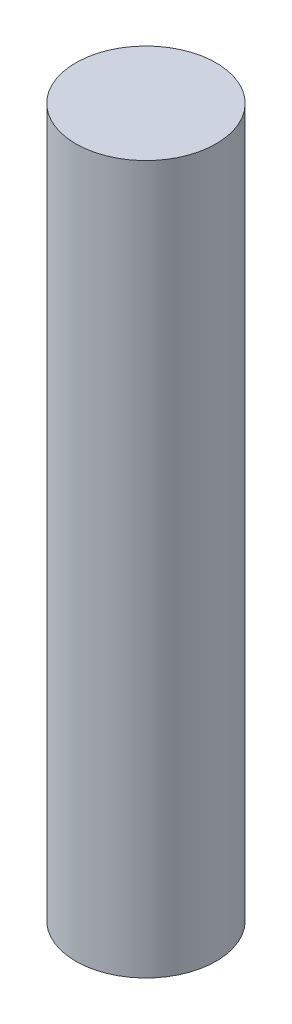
ISO-10303-21;
HEADER;
FILE_DESCRIPTION(('STEP AP214'),'2;1');
FILE_NAME('part.step','',(''),(''),'','','');
FILE_SCHEMA(('AUTOMOTIVE_DESIGN { 1 0 10303 214 1 1 1 1 }'));
ENDSEC;
DATA;
#1=APPLICATION_CONTEXT('core data for automotive mechanical design processes');
#2=APPLICATION_PROTOCOL_DEFINITION('international standard','automotive_design',2000,#1);
#3=PRODUCT_CONTEXT('',#1,'mechanical');
#4=PRODUCT('Part','Part','',(#3));
#5=PRODUCT_RELATED_PRODUCT_CATEGORY('part','',(#4));
#6=PRODUCT_DEFINITION_FORMATION('','',#4);
#7=PRODUCT_DEFINITION_CONTEXT('part definition',#1,'design');
#8=PRODUCT_DEFINITION('design','',#6,#7);
#9=PRODUCT_DEFINITION_SHAPE('','',#8);
#10=(LENGTH_UNIT() NAMED_UNIT(*) SI_UNIT(.MILLI.,.METRE.));
#11=(NAMED_UNIT(*) PLANE_ANGLE_UNIT() SI_UNIT($,.RADIAN.));
#12=(NAMED_UNIT(*) SI_UNIT($,.STERADIAN.) SOLID_ANGLE_UNIT());
#13=UNCERTAINTY_MEASURE_WITH_UNIT(LENGTH_MEASURE(1.E-05),#10,'distance_accuracy_value','');
#14=(GEOMETRIC_REPRESENTATION_CONTEXT(3) GLOBAL_UNCERTAINTY_ASSIGNED_CONTEXT((#13)) GLOBAL_UNIT_ASSIGNED_CONTEXT((#10,
#11,#12)) REPRESENTATION_CONTEXT('',''));
#15=CARTESIAN_POINT('',(0.,0.,0.));
#16=DIRECTION('',(0.,0.,1.));
#17=DIRECTION('',(1.,0.,0.));
#18=AXIS2_PLACEMENT_3D('',#15,#16,#17);
#19=CARTESIAN_POINT('',(0.,5.85,0.));
#20=DIRECTION('',(0.,-1.,0.));
#21=DIRECTION('',(0.,0.,-1.));
#22=AXIS2_PLACEMENT_3D('',#19,#20,#21);
#23=CYLINDRICAL_SURFACE('',#22,0.580000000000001);
#24=CARTESIAN_POINT('',(0.,5.85,0.));
#25=DIRECTION('',(0.,1.,0.));
#26=DIRECTION('',(0.,0.,1.));
#27=AXIS2_PLACEMENT_3D('',#24,#25,#26);
#28=CIRCLE('',#27,0.580000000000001);
#29=CARTESIAN_POINT('',(0.,5.85,0.580000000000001));
#30=VERTEX_POINT('',#29);
#31=EDGE_CURVE('E10',#30,#30,#28,.T.);
#32=ORIENTED_EDGE('',*,*,#31,.F.);
#33=EDGE_LOOP('',(#32));
#34=FACE_BOUND('',#33,.T.);
#35=CARTESIAN_POINT('',(0.,0.,0.));
#36=DIRECTION('',(0.,1.,0.));
#37=DIRECTION('',(0.,0.,1.));
#38=AXIS2_PLACEMENT_3D('',#35,#36,#37);
#39=CIRCLE('',#38,0.580000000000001);
#40=CARTESIAN_POINT('',(0.,0.,0.580000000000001));
#41=VERTEX_POINT('',#40);
#42=EDGE_CURVE('E38',#41,#41,#39,.T.);
#43=ORIENTED_EDGE('',*,*,#42,.T.);
#44=EDGE_LOOP('',(#43));
#45=FACE_BOUND('',#44,.T.);
#46=ADVANCED_FACE('F35',(#34,#45),#23,.T.);
#47=CARTESIAN_POINT('',(0.,5.85,0.));
#48=DIRECTION('',(0.,1.,0.));
#49=DIRECTION('',(0.,0.,1.));
#50=AXIS2_PLACEMENT_3D('',#47,#48,#49);
#51=PLANE('',#50);
#52=ORIENTED_EDGE('',*,*,#31,.T.);
#53=EDGE_LOOP('',(#52));
#54=FACE_BOUND('',#53,.T.);
#55=ADVANCED_FACE('F50',(#54),#51,.T.);
#56=CARTESIAN_POINT('',(0.,0.,0.));
#57=DIRECTION('',(0.,1.,0.));
#58=DIRECTION('',(0.,0.,1.));
#59=AXIS2_PLACEMENT_3D('',#56,#57,#58);
#60=PLANE('',#59);
#61=ORIENTED_EDGE('',*,*,#42,.F.);
#62=EDGE_LOOP('',(#61));
#63=FACE_BOUND('',#62,.T.);
#64=ADVANCED_FACE('F48',(#63),#60,.F.);
#65=CLOSED_SHELL('',(#46,#55,#64));
#66=MANIFOLD_SOLID_BREP('B2',#65);
#67=ADVANCED_BREP_SHAPE_REPRESENTATION('',(#18,#66),#14);
#68=SHAPE_DEFINITION_REPRESENTATION(#9,#67);
ENDSEC;
END-ISO-10303-21;
